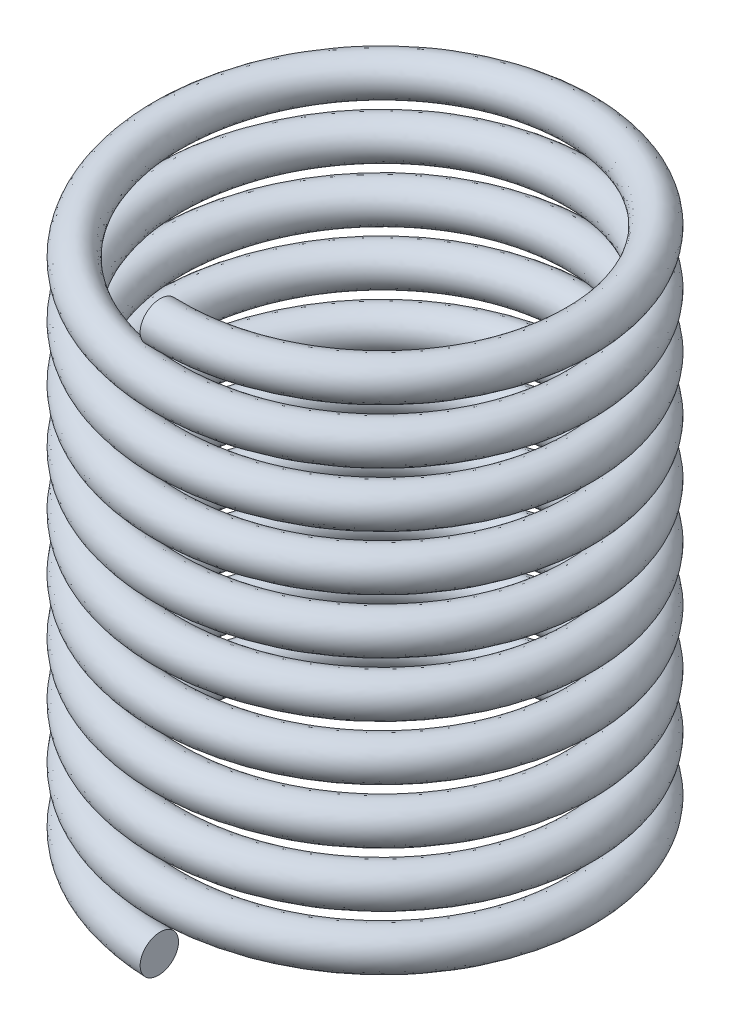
from build123d import *

# Parameters (mm, degrees)
SWEEP1_PITCH  = 10
SWEEP1_HEIGHT = 100
SWEEP1_RADIUS = 37.5
SKETCH2_R     = 3.5


with BuildPart() as part:
    # Sweep1: sweep along a helix
    with BuildLine() as sweep1_path:
        Helix(SWEEP1_PITCH, SWEEP1_HEIGHT, SWEEP1_RADIUS, center=(0, 0, 0), direction=(0, 1, 0), lefthand=True)
    # Sketch2 → Sweep1 (sweep)
    with BuildSketch(Plane(origin=(0, 0, 37.5), x_dir=(0, 0, 1), z_dir=(-0.9991005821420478, 0.04240314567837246, 0))):
        Circle(SKETCH2_R)
    sweep(path=sweep1_path.line, is_frenet=True)


solid = part.part
